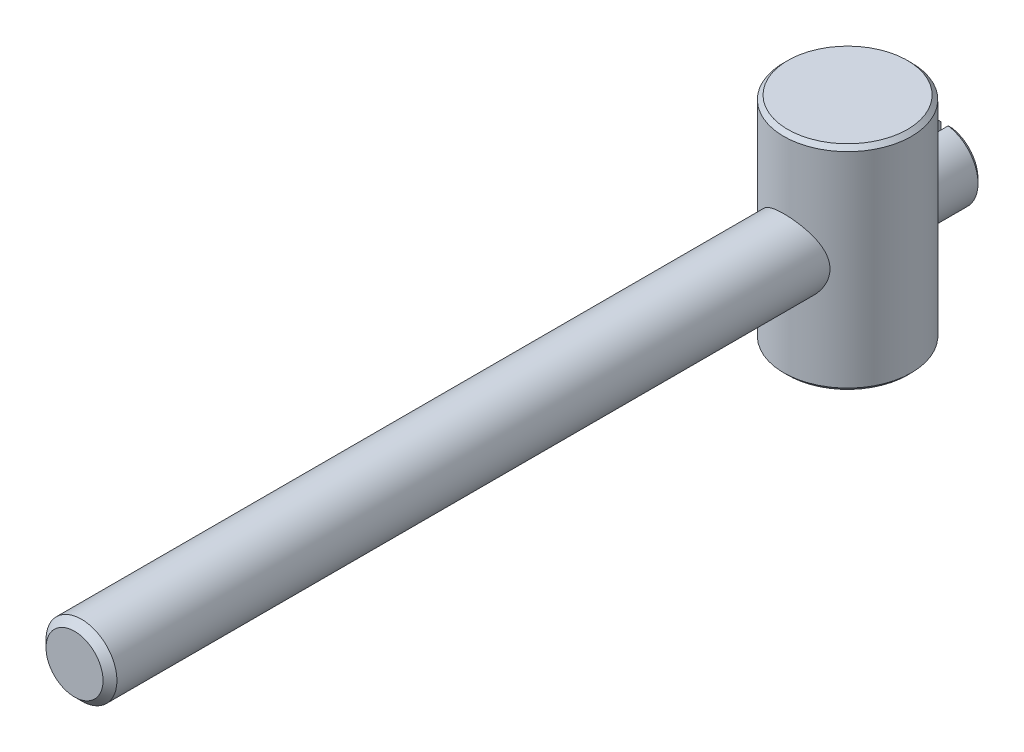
ISO-10303-21;
HEADER;
FILE_DESCRIPTION(('STEP AP214'),'2;1');
FILE_NAME('part.step','',(''),(''),'','','');
FILE_SCHEMA(('AUTOMOTIVE_DESIGN { 1 0 10303 214 1 1 1 1 }'));
ENDSEC;
DATA;
#1=APPLICATION_CONTEXT('core data for automotive mechanical design processes');
#2=APPLICATION_PROTOCOL_DEFINITION('international standard','automotive_design',2000,#1);
#3=PRODUCT_CONTEXT('',#1,'mechanical');
#4=PRODUCT('Part','Part','',(#3));
#5=PRODUCT_RELATED_PRODUCT_CATEGORY('part','',(#4));
#6=PRODUCT_DEFINITION_FORMATION('','',#4);
#7=PRODUCT_DEFINITION_CONTEXT('part definition',#1,'design');
#8=PRODUCT_DEFINITION('design','',#6,#7);
#9=PRODUCT_DEFINITION_SHAPE('','',#8);
#10=(LENGTH_UNIT() NAMED_UNIT(*) SI_UNIT(.MILLI.,.METRE.));
#11=(NAMED_UNIT(*) PLANE_ANGLE_UNIT() SI_UNIT($,.RADIAN.));
#12=(NAMED_UNIT(*) SI_UNIT($,.STERADIAN.) SOLID_ANGLE_UNIT());
#13=UNCERTAINTY_MEASURE_WITH_UNIT(LENGTH_MEASURE(1.E-05),#10,'distance_accuracy_value','');
#14=(GEOMETRIC_REPRESENTATION_CONTEXT(3) GLOBAL_UNCERTAINTY_ASSIGNED_CONTEXT((#13)) GLOBAL_UNIT_ASSIGNED_CONTEXT((#10,
#11,#12)) REPRESENTATION_CONTEXT('',''));
#15=CARTESIAN_POINT('',(0.,0.,0.));
#16=DIRECTION('',(0.,0.,1.));
#17=DIRECTION('',(1.,0.,0.));
#18=AXIS2_PLACEMENT_3D('',#15,#16,#17);
#19=CARTESIAN_POINT('',(0.,0.,-10.2));
#20=DIRECTION('',(0.,0.,1.));
#21=DIRECTION('',(1.,0.,0.));
#22=AXIS2_PLACEMENT_3D('',#19,#20,#21);
#23=CYLINDRICAL_SURFACE('',#22,2.5);
#24=CARTESIAN_POINT('',(2.5,0.,-10.9583426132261));
#25=CARTESIAN_POINT('',(2.4999886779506,-0.127867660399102,-10.9583273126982));
#26=CARTESIAN_POINT('',(2.49012046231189,-0.255847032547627,-10.9516829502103));
#27=CARTESIAN_POINT('',(2.45123834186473,-0.507679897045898,-10.92615160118));
#28=CARTESIAN_POINT('',(2.42219296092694,-0.631526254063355,-10.9072444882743));
#29=CARTESIAN_POINT('',(2.34672518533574,-0.870945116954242,-10.8601006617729));
#30=CARTESIAN_POINT('',(2.30041313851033,-0.986564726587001,-10.8319233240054));
#31=CARTESIAN_POINT('',(2.19206578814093,-1.20834600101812,-10.7695105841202));
#32=CARTESIAN_POINT('',(2.13002699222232,-1.31450555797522,-10.7352738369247));
#33=CARTESIAN_POINT('',(1.98449846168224,-1.52641671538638,-10.6603059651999));
#34=CARTESIAN_POINT('',(1.89945493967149,-1.63099357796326,-10.6192693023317));
#35=CARTESIAN_POINT('',(1.71353751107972,-1.82534633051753,-10.5377770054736));
#36=CARTESIAN_POINT('',(1.61265398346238,-1.91511315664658,-10.4973217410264));
#37=CARTESIAN_POINT('',(1.3870985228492,-2.08508983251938,-10.4173035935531));
#38=CARTESIAN_POINT('',(1.26111369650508,-2.16376032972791,-10.3781335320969));
#39=CARTESIAN_POINT('',(0.995108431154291,-2.29824166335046,-10.3092628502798));
#40=CARTESIAN_POINT('',(0.855099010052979,-2.35407027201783,-10.2795548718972));
#41=CARTESIAN_POINT('',(0.577542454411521,-2.43630568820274,-10.2351937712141));
#42=CARTESIAN_POINT('',(0.440787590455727,-2.46480060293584,-10.2194803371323));
#43=CARTESIAN_POINT('',(0.163616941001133,-2.49853448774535,-10.2008373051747));
#44=CARTESIAN_POINT('',(0.0232040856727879,-2.50379152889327,-10.1978977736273));
#45=CARTESIAN_POINT('',(-0.241178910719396,-2.4914765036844,-10.2047304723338));
#46=CARTESIAN_POINT('',(-0.365303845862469,-2.47628215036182,-10.2131788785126));
#47=CARTESIAN_POINT('',(-0.608906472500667,-2.42789099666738,-10.2397034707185));
#48=CARTESIAN_POINT('',(-0.728383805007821,-2.39469280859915,-10.2577803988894));
#49=CARTESIAN_POINT('',(-0.960979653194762,-2.31126649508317,-10.3021939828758));
#50=CARTESIAN_POINT('',(-1.07401990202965,-2.26086630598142,-10.3286138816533));
#51=CARTESIAN_POINT('',(-1.29025059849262,-2.14483738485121,-10.3874800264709));
#52=CARTESIAN_POINT('',(-1.39343793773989,-2.07920386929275,-10.4199281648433));
#53=CARTESIAN_POINT('',(-1.59909620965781,-1.92640653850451,-10.4921471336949));
#54=CARTESIAN_POINT('',(-1.70025747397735,-1.83767397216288,-10.5323306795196));
#55=CARTESIAN_POINT('',(-1.88703556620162,-1.64533173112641,-10.6134989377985));
#56=CARTESIAN_POINT('',(-1.97263574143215,-1.54170632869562,-10.6544844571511));
#57=CARTESIAN_POINT('',(-2.13367090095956,-1.31107929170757,-10.736876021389));
#58=CARTESIAN_POINT('',(-2.2074790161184,-1.1828097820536,-10.7779828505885));
#59=CARTESIAN_POINT('',(-2.30082855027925,-0.98066900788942,-10.8325082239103));
#60=CARTESIAN_POINT('',(-2.32905476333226,-0.91165285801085,-10.8494965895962));
#61=CARTESIAN_POINT('',(-2.3793879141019,-0.770776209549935,-10.8803947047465));
#62=CARTESIAN_POINT('',(-2.4014990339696,-0.698917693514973,-10.8943065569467));
#63=CARTESIAN_POINT('',(-2.43774893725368,-0.558744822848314,-10.9174339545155));
#64=CARTESIAN_POINT('',(-2.45238335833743,-0.490605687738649,-10.92693581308));
#65=CARTESIAN_POINT('',(-2.47593920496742,-0.352979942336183,-10.9423512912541));
#66=CARTESIAN_POINT('',(-2.48486399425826,-0.283494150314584,-10.9482670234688));
#67=CARTESIAN_POINT('',(-2.49684067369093,-0.143844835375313,-10.9562264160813));
#68=CARTESIAN_POINT('',(-2.49989709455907,-0.0736818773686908,-10.9582730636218));
#69=CARTESIAN_POINT('',(-2.5000979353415,0.0666321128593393,-10.958408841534));
#70=CARTESIAN_POINT('',(-2.49724303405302,0.136783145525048,-10.9564984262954));
#71=CARTESIAN_POINT('',(-2.48160454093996,0.325212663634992,-10.9460933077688));
#72=CARTESIAN_POINT('',(-2.4632791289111,0.442885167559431,-10.9339318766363));
#73=CARTESIAN_POINT('',(-2.41059641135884,0.673061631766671,-10.9000032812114));
#74=CARTESIAN_POINT('',(-2.37623178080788,0.785563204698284,-10.8782317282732));
#75=CARTESIAN_POINT('',(-2.29111009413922,1.00774180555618,-10.8265799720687));
#76=CARTESIAN_POINT('',(-2.23973536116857,1.11711092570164,-10.796402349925));
#77=CARTESIAN_POINT('',(-2.12255957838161,1.32632576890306,-10.7314706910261));
#78=CARTESIAN_POINT('',(-2.05675148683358,1.42616680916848,-10.6967144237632));
#79=CARTESIAN_POINT('',(-1.90016864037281,1.63049062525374,-10.6197869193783));
#80=CARTESIAN_POINT('',(-1.80707526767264,1.73309682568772,-10.5773277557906));
#81=CARTESIAN_POINT('',(-1.60470900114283,1.92199935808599,-10.4944234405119));
#82=CARTESIAN_POINT('',(-1.49542618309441,2.00828561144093,-10.453979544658));
#83=CARTESIAN_POINT('',(-1.25626042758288,2.16643294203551,-10.376991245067));
#84=CARTESIAN_POINT('',(-1.12558547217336,2.23726807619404,-10.3407737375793));
#85=CARTESIAN_POINT('',(-0.851602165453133,2.35519631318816,-10.2790936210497));
#86=CARTESIAN_POINT('',(-0.708307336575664,2.40231447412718,-10.2536196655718));
#87=CARTESIAN_POINT('',(-0.428990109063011,2.46664777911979,-10.218514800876));
#88=CARTESIAN_POINT('',(-0.293732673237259,2.48643742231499,-10.2075252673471));
#89=CARTESIAN_POINT('',(-0.0213910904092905,2.50362240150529,-10.1979932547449));
#90=CARTESIAN_POINT('',(0.115692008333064,2.50103007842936,-10.1994439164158));
#91=CARTESIAN_POINT('',(0.374337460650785,2.47491437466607,-10.2138982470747));
#92=CARTESIAN_POINT('',(0.49616574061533,2.45334235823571,-10.2258246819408));
#93=CARTESIAN_POINT('',(0.734167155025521,2.39292228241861,-10.2586674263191));
#94=CARTESIAN_POINT('',(0.8503396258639,2.3540722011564,-10.279584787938));
#95=CARTESIAN_POINT('',(1.0781477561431,2.25905612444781,-10.3294567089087));
#96=CARTESIAN_POINT('',(1.18950897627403,2.202363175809,-10.358652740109));
#97=CARTESIAN_POINT('',(1.40148896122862,2.07393542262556,-10.422372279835));
#98=CARTESIAN_POINT('',(1.50210346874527,2.00219469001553,-10.4568978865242));
#99=CARTESIAN_POINT('',(1.70217916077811,1.83613517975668,-10.532828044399));
#100=CARTESIAN_POINT('',(1.8001424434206,1.74016022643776,-10.5745654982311));
#101=CARTESIAN_POINT('',(1.97933250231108,1.53330418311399,-10.6574745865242));
#102=CARTESIAN_POINT('',(2.06053826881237,1.42240466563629,-10.6986454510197));
#103=CARTESIAN_POINT('',(2.20944802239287,1.17899936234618,-10.7787759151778));
#104=CARTESIAN_POINT('',(2.27579178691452,1.04552040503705,-10.8173734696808));
#105=CARTESIAN_POINT('',(2.35707752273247,0.83652666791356,-10.8665699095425));
#106=CARTESIAN_POINT('',(2.38112244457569,0.765460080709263,-10.881510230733));
#107=CARTESIAN_POINT('',(2.4228459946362,0.620861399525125,-10.9078467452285));
#108=CARTESIAN_POINT('',(2.44052862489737,0.547330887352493,-10.9192451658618));
#109=CARTESIAN_POINT('',(2.4697920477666,0.395409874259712,-10.9382915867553));
#110=CARTESIAN_POINT('',(2.48109451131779,0.316943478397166,-10.9457676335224));
#111=CARTESIAN_POINT('',(2.49620181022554,0.158999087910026,-10.9557977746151));
#112=CARTESIAN_POINT('',(2.50000704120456,0.0795211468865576,-10.9583521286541));
#113=CARTESIAN_POINT('',(2.5,0.,-10.9583426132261));
#114=B_SPLINE_CURVE_WITH_KNOTS('',3,(#24,#25,#26,#27,#28,#29,#30,#31,#32,#33,#34,#35,#36,#37,
#38,#39,#40,#41,#42,#43,#44,#45,#46,#47,#48,#49,#50,#51,#52,#53,#54,#55,#56,#57,#58,#59,#60,#61,
#62,#63,#64,#65,#66,#67,#68,#69,#70,#71,#72,#73,#74,#75,#76,#77,#78,#79,#80,#81,#82,#83,#84,#85,
#86,#87,#88,#89,#90,#91,#92,#93,#94,#95,#96,#97,#98,#99,#100,#101,#102,#103,#104,#105,#106,#107,
#108,#109,#110,#111,#112,#113),.UNSPECIFIED.,.T.,.F.,(4,2,2,2,2,2,2,2,2,2,2,2,2,2,2,2,2,2,2,2,2,
2,2,2,2,2,2,2,2,2,2,2,2,2,2,2,2,2,2,2,2,2,2,2,4),(0.,0.383275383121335,0.767181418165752,
1.14867490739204,1.53025318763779,1.95124472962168,2.37249297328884,2.8308639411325,
3.2888775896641,3.70817544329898,4.12714717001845,4.50138183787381,4.8756453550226,
5.25376784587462,5.63200923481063,6.05157027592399,6.47157769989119,6.92969119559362,
7.15882945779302,7.38781062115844,7.59850621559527,7.80907756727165,8.01948627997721,
8.22987083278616,8.58719279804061,8.94467811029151,9.31690871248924,9.68932132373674,
10.122176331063,10.5552977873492,11.0117233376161,11.4676656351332,11.8767730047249,
12.2856548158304,12.6568475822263,13.0280837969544,13.4115163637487,13.7951002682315,
14.2233400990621,14.6521136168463,15.1111969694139,15.3403711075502,15.5694008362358,
15.80777312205,16.0461328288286),.UNSPECIFIED.);
#115=CARTESIAN_POINT('',(2.5,0.,-10.9583426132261));
#116=VERTEX_POINT('',#115);
#117=EDGE_CURVE('E196',#116,#116,#114,.T.);
#118=ORIENTED_EDGE('',*,*,#117,.F.);
#119=EDGE_LOOP('',(#118));
#120=FACE_BOUND('',#119,.T.);
#121=CARTESIAN_POINT('',(0.,0.,39.3095));
#122=DIRECTION('',(0.,0.,1.));
#123=DIRECTION('',(1.,0.,0.));
#124=AXIS2_PLACEMENT_3D('',#121,#122,#123);
#125=CIRCLE('',#124,2.5);
#126=CARTESIAN_POINT('',(2.5,0.,39.3095));
#127=VERTEX_POINT('',#126);
#128=EDGE_CURVE('E204',#127,#127,#125,.T.);
#129=ORIENTED_EDGE('',*,*,#128,.F.);
#130=EDGE_LOOP('',(#129));
#131=FACE_BOUND('',#130,.T.);
#132=ADVANCED_FACE('F14',(#120,#131),#23,.T.);
#133=CARTESIAN_POINT('',(0.,0.,-21.3935));
#134=DIRECTION('',(0.,0.,1.));
#135=DIRECTION('',(1.,0.,0.));
#136=AXIS2_PLACEMENT_3D('',#133,#134,#135);
#137=CIRCLE('',#136,2.5);
#138=CARTESIAN_POINT('',(-0.4,2.46779253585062,-21.3935));
#139=VERTEX_POINT('',#138);
#140=CARTESIAN_POINT('',(-0.4,-2.46779253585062,-21.3935));
#141=VERTEX_POINT('',#140);
#142=EDGE_CURVE('E101',#139,#141,#137,.T.);
#143=ORIENTED_EDGE('',*,*,#142,.T.);
#144=DIRECTION('',(0.,0.,1.));
#145=VECTOR('',#144,1.);
#146=CARTESIAN_POINT('',(-0.4,-2.46779253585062,-10.2));
#147=LINE('',#146,#145);
#148=CARTESIAN_POINT('',(-0.4,-2.46779253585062,-20.296815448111));
#149=VERTEX_POINT('',#148);
#150=EDGE_CURVE('E148',#141,#149,#147,.T.);
#151=ORIENTED_EDGE('',*,*,#150,.T.);
#152=CARTESIAN_POINT('',(0.4,-2.46779253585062,-20.296815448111));
#153=CARTESIAN_POINT('',(0.333698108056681,-2.47854531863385,-20.2976618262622));
#154=CARTESIAN_POINT('',(0.266959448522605,-2.48661458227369,-20.298300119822));
#155=CARTESIAN_POINT('',(0.133478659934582,-2.49732458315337,-20.2991493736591));
#156=CARTESIAN_POINT('',(0.066739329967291,-2.5,-20.2993630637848));
#157=CARTESIAN_POINT('',(-0.066739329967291,-2.5,-20.2993630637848));
#158=CARTESIAN_POINT('',(-0.133478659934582,-2.49732458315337,-20.2991493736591));
#159=CARTESIAN_POINT('',(-0.266959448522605,-2.48661458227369,-20.298300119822));
#160=CARTESIAN_POINT('',(-0.333698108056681,-2.47854531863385,-20.2976618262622));
#161=CARTESIAN_POINT('',(-0.4,-2.46779253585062,-20.296815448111));
#162=B_SPLINE_CURVE_WITH_KNOTS('',3,(#152,#153,#154,#155,#156,#157,#158,#159,#160,#161),
.UNSPECIFIED.,.F.,.F.,(4,2,2,2,4),(0.,0.201464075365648,0.401628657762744,0.601793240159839,
0.803257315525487),.UNSPECIFIED.);
#163=CARTESIAN_POINT('',(0.4,-2.46779253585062,-20.296815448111));
#164=VERTEX_POINT('',#163);
#165=EDGE_CURVE('E141',#164,#149,#162,.T.);
#166=ORIENTED_EDGE('',*,*,#165,.F.);
#167=DIRECTION('',(0.,0.,1.));
#168=VECTOR('',#167,1.);
#169=CARTESIAN_POINT('',(0.4,-2.46779253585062,-10.2));
#170=LINE('',#169,#168);
#171=CARTESIAN_POINT('',(0.4,-2.46779253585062,-21.3935));
#172=VERTEX_POINT('',#171);
#173=EDGE_CURVE('E32',#172,#164,#170,.T.);
#174=ORIENTED_EDGE('',*,*,#173,.F.);
#175=CARTESIAN_POINT('',(0.4,2.46779253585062,-21.3935));
#176=VERTEX_POINT('',#175);
#177=EDGE_CURVE('E86',#172,#176,#137,.T.);
#178=ORIENTED_EDGE('',*,*,#177,.T.);
#179=DIRECTION('',(0.,0.,1.));
#180=VECTOR('',#179,1.);
#181=CARTESIAN_POINT('',(0.4,2.46779253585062,-10.2));
#182=LINE('',#181,#180);
#183=CARTESIAN_POINT('',(0.4,2.46779253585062,-20.296815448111));
#184=VERTEX_POINT('',#183);
#185=EDGE_CURVE('E38',#184,#176,#182,.F.);
#186=ORIENTED_EDGE('',*,*,#185,.F.);
#187=CARTESIAN_POINT('',(-0.4,2.46779253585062,-20.296815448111));
#188=CARTESIAN_POINT('',(-0.333698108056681,2.47854531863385,-20.2976618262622));
#189=CARTESIAN_POINT('',(-0.266959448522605,2.48661458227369,-20.298300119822));
#190=CARTESIAN_POINT('',(-0.133478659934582,2.49732458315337,-20.2991493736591));
#191=CARTESIAN_POINT('',(-0.066739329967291,2.5,-20.2993630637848));
#192=CARTESIAN_POINT('',(0.066739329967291,2.5,-20.2993630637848));
#193=CARTESIAN_POINT('',(0.133478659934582,2.49732458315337,-20.2991493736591));
#194=CARTESIAN_POINT('',(0.266959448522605,2.48661458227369,-20.298300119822));
#195=CARTESIAN_POINT('',(0.333698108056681,2.47854531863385,-20.2976618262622));
#196=CARTESIAN_POINT('',(0.4,2.46779253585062,-20.296815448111));
#197=B_SPLINE_CURVE_WITH_KNOTS('',3,(#187,#188,#189,#190,#191,#192,#193,#194,#195,#196),
.UNSPECIFIED.,.F.,.F.,(4,2,2,2,4),(0.,0.201464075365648,0.401628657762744,0.601793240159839,
0.803257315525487),.UNSPECIFIED.);
#198=CARTESIAN_POINT('',(-0.4,2.46779253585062,-20.296815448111));
#199=VERTEX_POINT('',#198);
#200=EDGE_CURVE('E73',#199,#184,#197,.T.);
#201=ORIENTED_EDGE('',*,*,#200,.F.);
#202=DIRECTION('',(0.,0.,1.));
#203=VECTOR('',#202,1.);
#204=CARTESIAN_POINT('',(-0.4,2.46779253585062,-10.2));
#205=LINE('',#204,#203);
#206=EDGE_CURVE('E79',#199,#139,#205,.F.);
#207=ORIENTED_EDGE('',*,*,#206,.T.);
#208=EDGE_LOOP('',(#143,#151,#166,#174,#178,#186,#201,#207));
#209=FACE_BOUND('',#208,.T.);
#210=CARTESIAN_POINT('',(2.5,0.,-18.441657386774));
#211=CARTESIAN_POINT('',(2.4999886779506,0.127867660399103,-18.4416726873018));
#212=CARTESIAN_POINT('',(2.49012046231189,0.255847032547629,-18.4483170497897));
#213=CARTESIAN_POINT('',(2.45123834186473,0.507679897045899,-18.47384839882));
#214=CARTESIAN_POINT('',(2.42219296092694,0.631526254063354,-18.4927555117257));
#215=CARTESIAN_POINT('',(2.34672518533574,0.870945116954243,-18.5398993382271));
#216=CARTESIAN_POINT('',(2.30041313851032,0.986564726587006,-18.5680766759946));
#217=CARTESIAN_POINT('',(2.19206578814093,1.20834600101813,-18.6304894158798));
#218=CARTESIAN_POINT('',(2.13002699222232,1.31450555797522,-18.6647261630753));
#219=CARTESIAN_POINT('',(1.98449846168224,1.52641671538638,-18.7396940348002));
#220=CARTESIAN_POINT('',(1.89945493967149,1.63099357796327,-18.7807306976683));
#221=CARTESIAN_POINT('',(1.71353751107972,1.82534633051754,-18.8622229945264));
#222=CARTESIAN_POINT('',(1.61265398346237,1.91511315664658,-18.9026782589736));
#223=CARTESIAN_POINT('',(1.3870985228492,2.08508983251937,-18.982696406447));
#224=CARTESIAN_POINT('',(1.26111369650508,2.16376032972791,-19.0218664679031));
#225=CARTESIAN_POINT('',(0.995108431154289,2.29824166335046,-19.0907371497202));
#226=CARTESIAN_POINT('',(0.855099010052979,2.35407027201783,-19.1204451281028));
#227=CARTESIAN_POINT('',(0.577542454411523,2.43630568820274,-19.1648062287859));
#228=CARTESIAN_POINT('',(0.440787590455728,2.46480060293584,-19.1805196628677));
#229=CARTESIAN_POINT('',(0.163616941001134,2.49853448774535,-19.1991626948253));
#230=CARTESIAN_POINT('',(0.0232040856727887,2.50379152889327,-19.2021022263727));
#231=CARTESIAN_POINT('',(-0.241178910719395,2.4914765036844,-19.1952695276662));
#232=CARTESIAN_POINT('',(-0.365303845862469,2.47628215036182,-19.1868211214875));
#233=CARTESIAN_POINT('',(-0.608906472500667,2.42789099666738,-19.1602965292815));
#234=CARTESIAN_POINT('',(-0.728383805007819,2.39469280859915,-19.1422196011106));
#235=CARTESIAN_POINT('',(-0.960979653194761,2.31126649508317,-19.0978060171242));
#236=CARTESIAN_POINT('',(-1.07401990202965,2.26086630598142,-19.0713861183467));
#237=CARTESIAN_POINT('',(-1.29025059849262,2.14483738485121,-19.0125199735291));
#238=CARTESIAN_POINT('',(-1.39343793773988,2.07920386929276,-18.9800718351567));
#239=CARTESIAN_POINT('',(-1.59909620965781,1.9264065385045,-18.9078528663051));
#240=CARTESIAN_POINT('',(-1.70025747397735,1.83767397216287,-18.8676693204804));
#241=CARTESIAN_POINT('',(-1.88703556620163,1.64533173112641,-18.7865010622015));
#242=CARTESIAN_POINT('',(-1.97263574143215,1.54170632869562,-18.7455155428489));
#243=CARTESIAN_POINT('',(-2.13367090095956,1.31107929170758,-18.663123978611));
#244=CARTESIAN_POINT('',(-2.2074790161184,1.1828097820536,-18.6220171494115));
#245=CARTESIAN_POINT('',(-2.30082855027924,0.980669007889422,-18.5674917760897));
#246=CARTESIAN_POINT('',(-2.32905476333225,0.911652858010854,-18.5505034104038));
#247=CARTESIAN_POINT('',(-2.3793879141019,0.770776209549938,-18.5196052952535));
#248=CARTESIAN_POINT('',(-2.4014990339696,0.698917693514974,-18.5056934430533));
#249=CARTESIAN_POINT('',(-2.43774893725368,0.558744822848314,-18.4825660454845));
#250=CARTESIAN_POINT('',(-2.45238335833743,0.490605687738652,-18.47306418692));
#251=CARTESIAN_POINT('',(-2.47593920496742,0.352979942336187,-18.4576487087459));
#252=CARTESIAN_POINT('',(-2.48486399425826,0.283494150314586,-18.4517329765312));
#253=CARTESIAN_POINT('',(-2.49684067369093,0.143844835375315,-18.4437735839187));
#254=CARTESIAN_POINT('',(-2.49989709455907,0.0736818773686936,-18.4417269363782));
#255=CARTESIAN_POINT('',(-2.5000979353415,-0.0666321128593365,-18.441591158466));
#256=CARTESIAN_POINT('',(-2.49724303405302,-0.136783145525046,-18.4435015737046));
#257=CARTESIAN_POINT('',(-2.48160454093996,-0.325212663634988,-18.4539066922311));
#258=CARTESIAN_POINT('',(-2.46327912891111,-0.442885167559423,-18.4660681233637));
#259=CARTESIAN_POINT('',(-2.41059641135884,-0.673061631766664,-18.4999967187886));
#260=CARTESIAN_POINT('',(-2.37623178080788,-0.785563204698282,-18.5217682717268));
#261=CARTESIAN_POINT('',(-2.29111009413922,-1.00774180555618,-18.5734200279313));
#262=CARTESIAN_POINT('',(-2.23973536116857,-1.11711092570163,-18.603597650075));
#263=CARTESIAN_POINT('',(-2.12255957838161,-1.32632576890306,-18.668529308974));
#264=CARTESIAN_POINT('',(-2.05675148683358,-1.42616680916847,-18.7032855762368));
#265=CARTESIAN_POINT('',(-1.90016864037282,-1.63049062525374,-18.7802130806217));
#266=CARTESIAN_POINT('',(-1.80707526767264,-1.73309682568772,-18.8226722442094));
#267=CARTESIAN_POINT('',(-1.60470900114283,-1.92199935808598,-18.9055765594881));
#268=CARTESIAN_POINT('',(-1.49542618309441,-2.00828561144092,-18.946020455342));
#269=CARTESIAN_POINT('',(-1.25626042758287,-2.16643294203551,-19.0230087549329));
#270=CARTESIAN_POINT('',(-1.12558547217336,-2.23726807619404,-19.0592262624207));
#271=CARTESIAN_POINT('',(-0.851602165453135,-2.35519631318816,-19.1209063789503));
#272=CARTESIAN_POINT('',(-0.708307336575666,-2.40231447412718,-19.1463803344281));
#273=CARTESIAN_POINT('',(-0.428990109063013,-2.46664777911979,-19.181485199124));
#274=CARTESIAN_POINT('',(-0.293732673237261,-2.48643742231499,-19.1924747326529));
#275=CARTESIAN_POINT('',(-0.0213910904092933,-2.50362240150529,-19.2020067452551));
#276=CARTESIAN_POINT('',(0.115692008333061,-2.50103007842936,-19.2005560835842));
#277=CARTESIAN_POINT('',(0.374337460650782,-2.47491437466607,-19.1861017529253));
#278=CARTESIAN_POINT('',(0.496165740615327,-2.45334235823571,-19.1741753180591));
#279=CARTESIAN_POINT('',(0.73416715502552,-2.39292228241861,-19.1413325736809));
#280=CARTESIAN_POINT('',(0.8503396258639,-2.3540722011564,-19.120415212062));
#281=CARTESIAN_POINT('',(1.07814775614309,-2.25905612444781,-19.0705432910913));
#282=CARTESIAN_POINT('',(1.18950897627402,-2.202363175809,-19.041347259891));
#283=CARTESIAN_POINT('',(1.40148896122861,-2.07393542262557,-18.977627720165));
#284=CARTESIAN_POINT('',(1.50210346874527,-2.00219469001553,-18.9431021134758));
#285=CARTESIAN_POINT('',(1.7021791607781,-1.83613517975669,-18.867171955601));
#286=CARTESIAN_POINT('',(1.80014244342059,-1.74016022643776,-18.825434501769));
#287=CARTESIAN_POINT('',(1.97933250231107,-1.533304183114,-18.7425254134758));
#288=CARTESIAN_POINT('',(2.06053826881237,-1.42240466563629,-18.7013545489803));
#289=CARTESIAN_POINT('',(2.20944802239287,-1.17899936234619,-18.6212240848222));
#290=CARTESIAN_POINT('',(2.27579178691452,-1.04552040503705,-18.5826265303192));
#291=CARTESIAN_POINT('',(2.35707752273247,-0.83652666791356,-18.5334300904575));
#292=CARTESIAN_POINT('',(2.38112244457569,-0.765460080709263,-18.518489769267));
#293=CARTESIAN_POINT('',(2.4228459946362,-0.620861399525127,-18.4921532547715));
#294=CARTESIAN_POINT('',(2.44052862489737,-0.547330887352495,-18.4807548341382));
#295=CARTESIAN_POINT('',(2.4697920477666,-0.395409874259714,-18.4617084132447));
#296=CARTESIAN_POINT('',(2.48109451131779,-0.316943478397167,-18.4542323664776));
#297=CARTESIAN_POINT('',(2.49620181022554,-0.158999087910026,-18.4442022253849));
#298=CARTESIAN_POINT('',(2.50000704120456,-0.0795211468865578,-18.4416478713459));
#299=CARTESIAN_POINT('',(2.5,0.,-18.441657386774));
#300=B_SPLINE_CURVE_WITH_KNOTS('',3,(#210,#211,#212,#213,#214,#215,#216,#217,#218,#219,#220,
#221,#222,#223,#224,#225,#226,#227,#228,#229,#230,#231,#232,#233,#234,#235,#236,#237,#238,#239,
#240,#241,#242,#243,#244,#245,#246,#247,#248,#249,#250,#251,#252,#253,#254,#255,#256,#257,#258,
#259,#260,#261,#262,#263,#264,#265,#266,#267,#268,#269,#270,#271,#272,#273,#274,#275,#276,#277,
#278,#279,#280,#281,#282,#283,#284,#285,#286,#287,#288,#289,#290,#291,#292,#293,#294,#295,#296,
#297,#298,#299),.UNSPECIFIED.,.T.,.F.,(4,2,2,2,2,2,2,2,2,2,2,2,2,2,2,2,2,2,2,2,2,2,2,2,2,2,2,2,
2,2,2,2,2,2,2,2,2,2,2,2,2,2,2,2,4),(0.,0.383275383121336,0.767181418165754,1.14867490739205,
1.53025318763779,1.95124472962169,2.37249297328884,2.8308639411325,3.2888775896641,
3.70817544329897,4.12714717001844,4.50138183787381,4.8756453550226,5.25376784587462,
5.63200923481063,6.05157027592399,6.47157769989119,6.92969119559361,7.15882945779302,
7.38781062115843,7.59850621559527,7.80907756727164,8.0194862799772,8.22987083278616,
8.5871927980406,8.9446781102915,9.31690871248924,9.68932132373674,10.122176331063,
10.5552977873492,11.0117233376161,11.4676656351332,11.8767730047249,12.2856548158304,
12.6568475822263,13.0280837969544,13.4115163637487,13.7951002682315,14.2233400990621,
14.6521136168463,15.1111969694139,15.3403711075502,15.5694008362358,15.80777312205,
16.0461328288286),.UNSPECIFIED.);
#301=CARTESIAN_POINT('',(2.5,0.,-18.441657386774));
#302=VERTEX_POINT('',#301);
#303=EDGE_CURVE('E192',#302,#302,#300,.T.);
#304=ORIENTED_EDGE('',*,*,#303,.F.);
#305=EDGE_LOOP('',(#304));
#306=FACE_BOUND('',#305,.T.);
#307=ADVANCED_FACE('F83',(#209,#306),#23,.T.);
#308=CARTESIAN_POINT('',(0.,0.,-21.7));
#309=DIRECTION('',(0.,0.,1.));
#310=DIRECTION('',(1.,0.,0.));
#311=AXIS2_PLACEMENT_3D('',#308,#309,#310);
#312=PLANE('',#311);
#313=DIRECTION('',(0.,-1.,0.));
#314=VECTOR('',#313,1.);
#315=CARTESIAN_POINT('',(0.4,0.,-21.7));
#316=LINE('',#315,#314);
#317=CARTESIAN_POINT('',(0.4,2.15672025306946,-21.7));
#318=VERTEX_POINT('',#317);
#319=CARTESIAN_POINT('',(0.4,-2.15672025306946,-21.7));
#320=VERTEX_POINT('',#319);
#321=EDGE_CURVE('E116',#318,#320,#316,.T.);
#322=ORIENTED_EDGE('',*,*,#321,.F.);
#323=CARTESIAN_POINT('',(0.,0.,-21.7));
#324=DIRECTION('',(0.,0.,1.));
#325=DIRECTION('',(1.,0.,0.));
#326=AXIS2_PLACEMENT_3D('',#323,#324,#325);
#327=CIRCLE('',#326,2.1935);
#328=EDGE_CURVE('E90',#320,#318,#327,.T.);
#329=ORIENTED_EDGE('',*,*,#328,.F.);
#330=EDGE_LOOP('',(#322,#329));
#331=FACE_BOUND('',#330,.T.);
#332=ADVANCED_FACE('F157',(#331),#312,.F.);
#333=CARTESIAN_POINT('',(0.,0.,-21.7));
#334=DIRECTION('',(0.,0.,1.));
#335=DIRECTION('',(1.,0.,0.));
#336=AXIS2_PLACEMENT_3D('',#333,#334,#335);
#337=CONICAL_SURFACE('',#336,2.1935,0.785398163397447);
#338=CARTESIAN_POINT('',(0.4,2.46850166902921,-21.3928));
#339=CARTESIAN_POINT('',(0.4,2.39793497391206,-21.4624547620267));
#340=CARTESIAN_POINT('',(0.4,2.32733326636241,-21.5320741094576));
#341=CARTESIAN_POINT('',(0.4,2.18597809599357,-21.6712614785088));
#342=CARTESIAN_POINT('',(0.4,2.11522456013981,-21.7408294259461));
#343=CARTESIAN_POINT('',(0.4,1.97263911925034,-21.8807619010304));
#344=CARTESIAN_POINT('',(0.4,1.90080545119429,-21.9511246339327));
#345=CARTESIAN_POINT('',(0.4,1.75700155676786,-22.0916061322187));
#346=CARTESIAN_POINT('',(0.4,1.68503146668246,-22.1617250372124));
#347=CARTESIAN_POINT('',(0.4,1.5086325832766,-22.3329478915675));
#348=CARTESIAN_POINT('',(0.4,1.40406116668,-22.4339055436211));
#349=CARTESIAN_POINT('',(0.4,1.24630024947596,-22.5846719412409));
#350=CARTESIAN_POINT('',(0.4,1.1934932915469,-22.6348806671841));
#351=CARTESIAN_POINT('',(0.4,1.08751861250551,-22.73488634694));
#352=CARTESIAN_POINT('',(0.4,1.03435099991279,-22.7846834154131));
#353=CARTESIAN_POINT('',(0.4,0.928027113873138,-22.8831356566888));
#354=CARTESIAN_POINT('',(0.4,0.87487688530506,-22.9317973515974));
#355=CARTESIAN_POINT('',(0.4,0.767646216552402,-23.0282154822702));
#356=CARTESIAN_POINT('',(0.4,0.713564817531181,-23.0759708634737));
#357=CARTESIAN_POINT('',(0.4,0.63143350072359,-23.1461630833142));
#358=CARTESIAN_POINT('',(0.4,0.603955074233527,-23.1692668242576));
#359=CARTESIAN_POINT('',(0.4,0.548479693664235,-23.2148412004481));
#360=CARTESIAN_POINT('',(0.4,0.520482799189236,-23.2373119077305));
#361=CARTESIAN_POINT('',(0.4,0.463815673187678,-23.2812861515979));
#362=CARTESIAN_POINT('',(0.4,0.435146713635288,-23.3027913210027));
#363=CARTESIAN_POINT('',(0.4,0.376790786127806,-23.3443654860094));
#364=CARTESIAN_POINT('',(0.4,0.347104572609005,-23.364435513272));
#365=CARTESIAN_POINT('',(0.4,0.309473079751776,-23.3877901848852));
#366=CARTESIAN_POINT('',(0.4,0.302223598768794,-23.3921969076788));
#367=CARTESIAN_POINT('',(0.4,0.287631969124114,-23.4008566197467));
#368=CARTESIAN_POINT('',(0.4,0.28028980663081,-23.4051095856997));
#369=CARTESIAN_POINT('',(0.4,0.258114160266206,-23.4176076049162));
#370=CARTESIAN_POINT('',(0.4,0.243131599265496,-23.4255917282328));
#371=CARTESIAN_POINT('',(0.4,0.212839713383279,-23.4405880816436));
#372=CARTESIAN_POINT('',(0.4,0.197534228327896,-23.4476079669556));
#373=CARTESIAN_POINT('',(0.4,0.166442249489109,-23.460484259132));
#374=CARTESIAN_POINT('',(0.4,0.150655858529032,-23.4663409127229));
#375=CARTESIAN_POINT('',(0.4,0.111435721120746,-23.4788472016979));
#376=CARTESIAN_POINT('',(0.4,0.0877285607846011,-23.4846874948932));
#377=CARTESIAN_POINT('',(0.4,0.0397057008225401,-23.4922264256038));
#378=CARTESIAN_POINT('',(0.4,0.0153922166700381,-23.4939383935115));
#379=CARTESIAN_POINT('',(0.4,-0.0331703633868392,-23.4928640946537));
#380=CARTESIAN_POINT('',(0.4,-0.0574192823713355,-23.4900702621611));
#381=CARTESIAN_POINT('',(0.4,-0.10517632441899,-23.4805736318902));
#382=CARTESIAN_POINT('',(0.4,-0.128681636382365,-23.4738575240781));
#383=CARTESIAN_POINT('',(0.4,-0.178283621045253,-23.4562788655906));
#384=CARTESIAN_POINT('',(0.4,-0.20420033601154,-23.4449277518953));
#385=CARTESIAN_POINT('',(0.4,-0.254817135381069,-23.4197398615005));
#386=CARTESIAN_POINT('',(0.4,-0.279514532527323,-23.4058978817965));
#387=CARTESIAN_POINT('',(0.4,-0.328121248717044,-23.3765020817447));
#388=CARTESIAN_POINT('',(0.4,-0.352022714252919,-23.3609354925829));
#389=CARTESIAN_POINT('',(0.4,-0.399055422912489,-23.3287412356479));
#390=CARTESIAN_POINT('',(0.4,-0.422187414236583,-23.3121146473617));
#391=CARTESIAN_POINT('',(0.4,-0.4702689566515,-23.2763546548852));
#392=CARTESIAN_POINT('',(0.4,-0.495157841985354,-23.2571402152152));
#393=CARTESIAN_POINT('',(0.4,-0.544438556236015,-23.21808210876));
#394=CARTESIAN_POINT('',(0.4,-0.568830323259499,-23.1982383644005));
#395=CARTESIAN_POINT('',(0.4,-0.641472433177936,-23.1380236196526));
#396=CARTESIAN_POINT('',(0.4,-0.689168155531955,-23.0969855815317));
#397=CARTESIAN_POINT('',(0.4,-0.783758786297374,-23.013853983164));
#398=CARTESIAN_POINT('',(0.4,-0.83065225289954,-22.9717588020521));
#399=CARTESIAN_POINT('',(0.4,-0.923855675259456,-22.8869523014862));
#400=CARTESIAN_POINT('',(0.4,-0.970165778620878,-22.8442411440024));
#401=CARTESIAN_POINT('',(0.4,-1.10817311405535,-22.7158338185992));
#402=CARTESIAN_POINT('',(0.4,-1.19931044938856,-22.6295376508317));
#403=CARTESIAN_POINT('',(0.4,-1.38074793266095,-22.4562216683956));
#404=CARTESIAN_POINT('',(0.4,-1.47104870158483,-22.3692024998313));
#405=CARTESIAN_POINT('',(0.4,-1.63710859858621,-22.2083381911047));
#406=CARTESIAN_POINT('',(0.4,-1.71293348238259,-22.1345609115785));
#407=CARTESIAN_POINT('',(0.4,-1.86438262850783,-21.9867617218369));
#408=CARTESIAN_POINT('',(0.4,-1.94000683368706,-21.9127397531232));
#409=CARTESIAN_POINT('',(0.4,-2.09118466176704,-21.7644543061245));
#410=CARTESIAN_POINT('',(0.4,-2.16673811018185,-21.6901906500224));
#411=CARTESIAN_POINT('',(0.4,-2.31770791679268,-21.5415644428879));
#412=CARTESIAN_POINT('',(0.4,-2.39312430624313,-21.4672019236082));
#413=CARTESIAN_POINT('',(0.4,-2.46850166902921,-21.3928));
#414=B_SPLINE_CURVE_WITH_KNOTS('',3,(#338,#339,#340,#341,#342,#343,#344,#345,#346,#347,#348,
#349,#350,#351,#352,#353,#354,#355,#356,#357,#358,#359,#360,#361,#362,#363,#364,#365,#366,#367,
#368,#369,#370,#371,#372,#373,#374,#375,#376,#377,#378,#379,#380,#381,#382,#383,#384,#385,#386,
#387,#388,#389,#390,#391,#392,#393,#394,#395,#396,#397,#398,#399,#400,#401,#402,#403,#404,#405,
#406,#407,#408,#409,#410,#411,#412,#413),.UNSPECIFIED.,.F.,.F.,(4,2,2,2,2,2,2,2,2,2,2,2,2,2,2,2,
2,2,2,2,2,2,2,2,2,2,2,2,2,2,2,2,2,2,2,2,2,4),(0.,0.29746095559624,0.595138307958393,
0.896798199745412,1.19823998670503,1.63429513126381,1.85289273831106,2.07142725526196,
2.28760816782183,2.5040268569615,2.61172252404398,2.71940588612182,2.82689970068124,
2.93431544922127,2.9597650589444,2.98521851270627,3.0361257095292,3.08660196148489,
3.13706749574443,3.2100182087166,3.28273304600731,3.35557010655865,3.42865578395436,
3.51332827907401,3.5981797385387,3.68370773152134,3.76914997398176,3.86346381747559,
3.95778933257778,4.14652139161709,4.33556300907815,4.52455579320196,4.90107746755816,
5.27729270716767,5.59467575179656,5.91214113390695,6.22996283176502,6.54769954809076),.UNSPECIFIED.);
#415=EDGE_CURVE('E128',#176,#318,#414,.T.);
#416=ORIENTED_EDGE('',*,*,#415,.F.);
#417=ORIENTED_EDGE('',*,*,#177,.F.);
#418=EDGE_CURVE('E115',#320,#172,#414,.T.);
#419=ORIENTED_EDGE('',*,*,#418,.F.);
#420=ORIENTED_EDGE('',*,*,#328,.T.);
#421=EDGE_LOOP('',(#416,#417,#419,#420));
#422=FACE_BOUND('',#421,.T.);
#423=ADVANCED_FACE('F124',(#422),#337,.T.);
#424=CARTESIAN_POINT('',(-0.4,2.15672025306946,-21.7));
#425=VERTEX_POINT('',#424);
#426=CARTESIAN_POINT('',(-0.4,-2.15672025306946,-21.7));
#427=VERTEX_POINT('',#426);
#428=EDGE_CURVE('E87',#425,#427,#327,.T.);
#429=ORIENTED_EDGE('',*,*,#428,.F.);
#430=DIRECTION('',(0.,-1.,0.));
#431=VECTOR('',#430,1.);
#432=CARTESIAN_POINT('',(-0.4,0.,-21.7));
#433=LINE('',#432,#431);
#434=EDGE_CURVE('E104',#425,#427,#433,.T.);
#435=ORIENTED_EDGE('',*,*,#434,.T.);
#436=EDGE_LOOP('',(#429,#435));
#437=FACE_BOUND('',#436,.T.);
#438=ADVANCED_FACE('F122',(#437),#312,.F.);
#439=ORIENTED_EDGE('',*,*,#142,.F.);
#440=CARTESIAN_POINT('',(-0.4,2.46850166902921,-21.3928));
#441=CARTESIAN_POINT('',(-0.4,2.39793497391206,-21.4624547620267));
#442=CARTESIAN_POINT('',(-0.4,2.32733326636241,-21.5320741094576));
#443=CARTESIAN_POINT('',(-0.4,2.18597809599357,-21.6712614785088));
#444=CARTESIAN_POINT('',(-0.4,2.11522456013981,-21.7408294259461));
#445=CARTESIAN_POINT('',(-0.4,1.97263911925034,-21.8807619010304));
#446=CARTESIAN_POINT('',(-0.4,1.90080545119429,-21.9511246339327));
#447=CARTESIAN_POINT('',(-0.4,1.75700155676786,-22.0916061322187));
#448=CARTESIAN_POINT('',(-0.4,1.68503146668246,-22.1617250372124));
#449=CARTESIAN_POINT('',(-0.4,1.5086325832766,-22.3329478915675));
#450=CARTESIAN_POINT('',(-0.4,1.40406116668,-22.4339055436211));
#451=CARTESIAN_POINT('',(-0.4,1.24630024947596,-22.5846719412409));
#452=CARTESIAN_POINT('',(-0.4,1.1934932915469,-22.6348806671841));
#453=CARTESIAN_POINT('',(-0.4,1.08751861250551,-22.73488634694));
#454=CARTESIAN_POINT('',(-0.4,1.03435099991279,-22.7846834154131));
#455=CARTESIAN_POINT('',(-0.4,0.928027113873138,-22.8831356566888));
#456=CARTESIAN_POINT('',(-0.4,0.87487688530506,-22.9317973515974));
#457=CARTESIAN_POINT('',(-0.4,0.767646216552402,-23.0282154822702));
#458=CARTESIAN_POINT('',(-0.4,0.713564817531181,-23.0759708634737));
#459=CARTESIAN_POINT('',(-0.4,0.63143350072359,-23.1461630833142));
#460=CARTESIAN_POINT('',(-0.4,0.603955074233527,-23.1692668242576));
#461=CARTESIAN_POINT('',(-0.4,0.548479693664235,-23.2148412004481));
#462=CARTESIAN_POINT('',(-0.4,0.520482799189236,-23.2373119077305));
#463=CARTESIAN_POINT('',(-0.4,0.463815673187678,-23.2812861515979));
#464=CARTESIAN_POINT('',(-0.4,0.435146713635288,-23.3027913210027));
#465=CARTESIAN_POINT('',(-0.4,0.376790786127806,-23.3443654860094));
#466=CARTESIAN_POINT('',(-0.4,0.347104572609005,-23.364435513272));
#467=CARTESIAN_POINT('',(-0.4,0.309473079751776,-23.3877901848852));
#468=CARTESIAN_POINT('',(-0.4,0.302223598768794,-23.3921969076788));
#469=CARTESIAN_POINT('',(-0.4,0.287631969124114,-23.4008566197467));
#470=CARTESIAN_POINT('',(-0.4,0.28028980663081,-23.4051095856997));
#471=CARTESIAN_POINT('',(-0.4,0.258114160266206,-23.4176076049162));
#472=CARTESIAN_POINT('',(-0.4,0.243131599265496,-23.4255917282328));
#473=CARTESIAN_POINT('',(-0.4,0.212839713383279,-23.4405880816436));
#474=CARTESIAN_POINT('',(-0.4,0.197534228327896,-23.4476079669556));
#475=CARTESIAN_POINT('',(-0.4,0.166442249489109,-23.460484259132));
#476=CARTESIAN_POINT('',(-0.4,0.150655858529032,-23.4663409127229));
#477=CARTESIAN_POINT('',(-0.4,0.111435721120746,-23.4788472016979));
#478=CARTESIAN_POINT('',(-0.4,0.0877285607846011,-23.4846874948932));
#479=CARTESIAN_POINT('',(-0.4,0.0397057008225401,-23.4922264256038));
#480=CARTESIAN_POINT('',(-0.4,0.0153922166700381,-23.4939383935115));
#481=CARTESIAN_POINT('',(-0.4,-0.0331703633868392,-23.4928640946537));
#482=CARTESIAN_POINT('',(-0.4,-0.0574192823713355,-23.4900702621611));
#483=CARTESIAN_POINT('',(-0.4,-0.10517632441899,-23.4805736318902));
#484=CARTESIAN_POINT('',(-0.4,-0.128681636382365,-23.4738575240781));
#485=CARTESIAN_POINT('',(-0.4,-0.178283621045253,-23.4562788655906));
#486=CARTESIAN_POINT('',(-0.4,-0.20420033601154,-23.4449277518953));
#487=CARTESIAN_POINT('',(-0.4,-0.254817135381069,-23.4197398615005));
#488=CARTESIAN_POINT('',(-0.4,-0.279514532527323,-23.4058978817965));
#489=CARTESIAN_POINT('',(-0.4,-0.328121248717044,-23.3765020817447));
#490=CARTESIAN_POINT('',(-0.4,-0.352022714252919,-23.3609354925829));
#491=CARTESIAN_POINT('',(-0.4,-0.399055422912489,-23.3287412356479));
#492=CARTESIAN_POINT('',(-0.4,-0.422187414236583,-23.3121146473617));
#493=CARTESIAN_POINT('',(-0.4,-0.4702689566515,-23.2763546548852));
#494=CARTESIAN_POINT('',(-0.4,-0.495157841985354,-23.2571402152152));
#495=CARTESIAN_POINT('',(-0.4,-0.544438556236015,-23.21808210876));
#496=CARTESIAN_POINT('',(-0.4,-0.568830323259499,-23.1982383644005));
#497=CARTESIAN_POINT('',(-0.4,-0.641472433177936,-23.1380236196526));
#498=CARTESIAN_POINT('',(-0.4,-0.689168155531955,-23.0969855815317));
#499=CARTESIAN_POINT('',(-0.4,-0.783758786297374,-23.013853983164));
#500=CARTESIAN_POINT('',(-0.4,-0.83065225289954,-22.9717588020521));
#501=CARTESIAN_POINT('',(-0.4,-0.923855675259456,-22.8869523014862));
#502=CARTESIAN_POINT('',(-0.4,-0.970165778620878,-22.8442411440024));
#503=CARTESIAN_POINT('',(-0.4,-1.10817311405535,-22.7158338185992));
#504=CARTESIAN_POINT('',(-0.4,-1.19931044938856,-22.6295376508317));
#505=CARTESIAN_POINT('',(-0.4,-1.38074793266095,-22.4562216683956));
#506=CARTESIAN_POINT('',(-0.4,-1.47104870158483,-22.3692024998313));
#507=CARTESIAN_POINT('',(-0.4,-1.63710859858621,-22.2083381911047));
#508=CARTESIAN_POINT('',(-0.4,-1.71293348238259,-22.1345609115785));
#509=CARTESIAN_POINT('',(-0.4,-1.86438262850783,-21.9867617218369));
#510=CARTESIAN_POINT('',(-0.4,-1.94000683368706,-21.9127397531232));
#511=CARTESIAN_POINT('',(-0.4,-2.09118466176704,-21.7644543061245));
#512=CARTESIAN_POINT('',(-0.4,-2.16673811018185,-21.6901906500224));
#513=CARTESIAN_POINT('',(-0.4,-2.31770791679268,-21.5415644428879));
#514=CARTESIAN_POINT('',(-0.4,-2.39312430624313,-21.4672019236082));
#515=CARTESIAN_POINT('',(-0.4,-2.46850166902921,-21.3928));
#516=B_SPLINE_CURVE_WITH_KNOTS('',3,(#440,#441,#442,#443,#444,#445,#446,#447,#448,#449,#450,
#451,#452,#453,#454,#455,#456,#457,#458,#459,#460,#461,#462,#463,#464,#465,#466,#467,#468,#469,
#470,#471,#472,#473,#474,#475,#476,#477,#478,#479,#480,#481,#482,#483,#484,#485,#486,#487,#488,
#489,#490,#491,#492,#493,#494,#495,#496,#497,#498,#499,#500,#501,#502,#503,#504,#505,#506,#507,
#508,#509,#510,#511,#512,#513,#514,#515),.UNSPECIFIED.,.F.,.F.,(4,2,2,2,2,2,2,2,2,2,2,2,2,2,2,2,
2,2,2,2,2,2,2,2,2,2,2,2,2,2,2,2,2,2,2,2,2,4),(0.,0.29746095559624,0.595138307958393,
0.896798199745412,1.19823998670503,1.63429513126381,1.85289273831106,2.07142725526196,
2.28760816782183,2.5040268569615,2.61172252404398,2.71940588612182,2.82689970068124,
2.93431544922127,2.9597650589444,2.98521851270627,3.0361257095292,3.08660196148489,
3.13706749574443,3.2100182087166,3.28273304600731,3.35557010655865,3.42865578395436,
3.51332827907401,3.5981797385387,3.68370773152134,3.76914997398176,3.86346381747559,
3.95778933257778,4.14652139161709,4.33556300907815,4.52455579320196,4.90107746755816,
5.27729270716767,5.59467575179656,5.91214113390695,6.22996283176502,6.54769954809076),.UNSPECIFIED.);
#517=EDGE_CURVE('E107',#139,#425,#516,.T.);
#518=ORIENTED_EDGE('',*,*,#517,.T.);
#519=ORIENTED_EDGE('',*,*,#428,.T.);
#520=EDGE_CURVE('E103',#427,#141,#516,.T.);
#521=ORIENTED_EDGE('',*,*,#520,.T.);
#522=EDGE_LOOP('',(#439,#518,#519,#521));
#523=FACE_BOUND('',#522,.T.);
#524=ADVANCED_FACE('F118',(#523),#337,.T.);
#525=CARTESIAN_POINT('',(-0.4,0.,-51.7));
#526=DIRECTION('',(1.,0.,0.));
#527=DIRECTION('',(0.,-1.,0.));
#528=AXIS2_PLACEMENT_3D('',#525,#526,#527);
#529=CYLINDRICAL_SURFACE('',#528,31.5);
#530=CARTESIAN_POINT('',(-0.4,0.,-51.7));
#531=DIRECTION('',(-1.,0.,0.));
#532=DIRECTION('',(0.,1.,0.));
#533=AXIS2_PLACEMENT_3D('',#530,#531,#532);
#534=CIRCLE('',#533,31.5);
#535=EDGE_CURVE('E19',#149,#199,#534,.T.);
#536=ORIENTED_EDGE('',*,*,#535,.T.);
#537=ORIENTED_EDGE('',*,*,#200,.T.);
#538=CARTESIAN_POINT('',(0.4,0.,-51.7));
#539=DIRECTION('',(-1.,0.,0.));
#540=DIRECTION('',(0.,1.,0.));
#541=AXIS2_PLACEMENT_3D('',#538,#539,#540);
#542=CIRCLE('',#541,31.5);
#543=EDGE_CURVE('E66',#164,#184,#542,.T.);
#544=ORIENTED_EDGE('',*,*,#543,.F.);
#545=ORIENTED_EDGE('',*,*,#165,.T.);
#546=EDGE_LOOP('',(#536,#537,#544,#545));
#547=FACE_BOUND('',#546,.T.);
#548=ADVANCED_FACE('F74',(#547),#529,.F.);
#549=CARTESIAN_POINT('',(-0.4,0.,-51.7));
#550=DIRECTION('',(-1.,0.,0.));
#551=DIRECTION('',(0.,1.,0.));
#552=AXIS2_PLACEMENT_3D('',#549,#550,#551);
#553=PLANE('',#552);
#554=ORIENTED_EDGE('',*,*,#520,.F.);
#555=ORIENTED_EDGE('',*,*,#434,.F.);
#556=ORIENTED_EDGE('',*,*,#517,.F.);
#557=ORIENTED_EDGE('',*,*,#206,.F.);
#558=ORIENTED_EDGE('',*,*,#535,.F.);
#559=ORIENTED_EDGE('',*,*,#150,.F.);
#560=EDGE_LOOP('',(#554,#555,#556,#557,#558,#559));
#561=FACE_BOUND('',#560,.T.);
#562=ADVANCED_FACE('F16',(#561),#553,.F.);
#563=CARTESIAN_POINT('',(0.4,0.,-51.7));
#564=DIRECTION('',(-1.,0.,0.));
#565=DIRECTION('',(0.,1.,0.));
#566=AXIS2_PLACEMENT_3D('',#563,#564,#565);
#567=PLANE('',#566);
#568=ORIENTED_EDGE('',*,*,#173,.T.);
#569=ORIENTED_EDGE('',*,*,#543,.T.);
#570=ORIENTED_EDGE('',*,*,#185,.T.);
#571=ORIENTED_EDGE('',*,*,#415,.T.);
#572=ORIENTED_EDGE('',*,*,#321,.T.);
#573=ORIENTED_EDGE('',*,*,#418,.T.);
#574=EDGE_LOOP('',(#568,#569,#570,#571,#572,#573));
#575=FACE_BOUND('',#574,.T.);
#576=ADVANCED_FACE('F68',(#575),#567,.T.);
#577=CARTESIAN_POINT('',(0.,-7.5,-14.7));
#578=DIRECTION('',(0.,1.,0.));
#579=DIRECTION('',(1.,0.,0.));
#580=AXIS2_PLACEMENT_3D('',#577,#578,#579);
#581=PLANE('',#580);
#582=CARTESIAN_POINT('',(0.,-7.5,-14.7));
#583=DIRECTION('',(0.,1.,0.));
#584=DIRECTION('',(1.,0.,0.));
#585=AXIS2_PLACEMENT_3D('',#582,#583,#584);
#586=CIRCLE('',#585,4.21715728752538);
#587=CARTESIAN_POINT('',(4.21715728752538,-7.5,-14.7));
#588=VERTEX_POINT('',#587);
#589=EDGE_CURVE('E71',#588,#588,#586,.T.);
#590=ORIENTED_EDGE('',*,*,#589,.F.);
#591=EDGE_LOOP('',(#590));
#592=FACE_BOUND('',#591,.T.);
#593=ADVANCED_FACE('F135',(#592),#581,.F.);
#594=CARTESIAN_POINT('',(0.,7.5,-18.9171572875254));
#595=DIRECTION('',(0.,-1.,0.));
#596=DIRECTION('',(-1.,0.,0.));
#597=AXIS2_PLACEMENT_3D('',#594,#595,#596);
#598=PLANE('',#597);
#599=CARTESIAN_POINT('',(0.,7.5,-14.7));
#600=DIRECTION('',(0.,1.,0.));
#601=DIRECTION('',(1.,0.,0.));
#602=AXIS2_PLACEMENT_3D('',#599,#600,#601);
#603=CIRCLE('',#602,4.21715728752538);
#604=CARTESIAN_POINT('',(4.21715728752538,7.5,-14.7));
#605=VERTEX_POINT('',#604);
#606=EDGE_CURVE('E9',#605,#605,#603,.T.);
#607=ORIENTED_EDGE('',*,*,#606,.T.);
#608=EDGE_LOOP('',(#607));
#609=FACE_BOUND('',#608,.T.);
#610=ADVANCED_FACE('F167',(#609),#598,.F.);
#611=CARTESIAN_POINT('',(0.,-7.5,-14.7));
#612=DIRECTION('',(0.,1.,0.));
#613=DIRECTION('',(1.,0.,0.));
#614=AXIS2_PLACEMENT_3D('',#611,#612,#613);
#615=CONICAL_SURFACE('',#614,4.21715728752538,0.78539816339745);
#616=CARTESIAN_POINT('',(0.,-7.21715728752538,-14.7));
#617=DIRECTION('',(0.,1.,0.));
#618=DIRECTION('',(1.,0.,0.));
#619=AXIS2_PLACEMENT_3D('',#616,#617,#618);
#620=CIRCLE('',#619,4.5);
#621=CARTESIAN_POINT('',(4.5,-7.21715728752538,-14.7));
#622=VERTEX_POINT('',#621);
#623=EDGE_CURVE('E217',#622,#622,#620,.T.);
#624=ORIENTED_EDGE('',*,*,#623,.F.);
#625=EDGE_LOOP('',(#624));
#626=FACE_BOUND('',#625,.T.);
#627=ORIENTED_EDGE('',*,*,#589,.T.);
#628=EDGE_LOOP('',(#627));
#629=FACE_BOUND('',#628,.T.);
#630=ADVANCED_FACE('F174',(#626,#629),#615,.T.);
#631=CARTESIAN_POINT('',(0.,7.21715728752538,-14.7));
#632=DIRECTION('',(0.,-1.,0.));
#633=DIRECTION('',(-1.,0.,0.));
#634=AXIS2_PLACEMENT_3D('',#631,#632,#633);
#635=CONICAL_SURFACE('',#634,4.5,0.785398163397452);
#636=ORIENTED_EDGE('',*,*,#606,.F.);
#637=EDGE_LOOP('',(#636));
#638=FACE_BOUND('',#637,.T.);
#639=CARTESIAN_POINT('',(0.,7.21715728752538,-14.7));
#640=DIRECTION('',(0.,1.,0.));
#641=DIRECTION('',(1.,0.,0.));
#642=AXIS2_PLACEMENT_3D('',#639,#640,#641);
#643=CIRCLE('',#642,4.5);
#644=CARTESIAN_POINT('',(4.5,7.21715728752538,-14.7));
#645=VERTEX_POINT('',#644);
#646=EDGE_CURVE('E24',#645,#645,#643,.T.);
#647=ORIENTED_EDGE('',*,*,#646,.T.);
#648=EDGE_LOOP('',(#647));
#649=FACE_BOUND('',#648,.T.);
#650=ADVANCED_FACE('F182',(#638,#649),#635,.T.);
#651=CARTESIAN_POINT('',(0.,7.5,-14.7));
#652=DIRECTION('',(0.,1.,0.));
#653=DIRECTION('',(1.,0.,0.));
#654=AXIS2_PLACEMENT_3D('',#651,#652,#653);
#655=CYLINDRICAL_SURFACE('',#654,4.5);
#656=ORIENTED_EDGE('',*,*,#646,.F.);
#657=EDGE_LOOP('',(#656));
#658=FACE_BOUND('',#657,.T.);
#659=ORIENTED_EDGE('',*,*,#623,.T.);
#660=EDGE_LOOP('',(#659));
#661=FACE_BOUND('',#660,.T.);
#662=ORIENTED_EDGE('',*,*,#117,.T.);
#663=EDGE_LOOP('',(#662));
#664=FACE_BOUND('',#663,.T.);
#665=ORIENTED_EDGE('',*,*,#303,.T.);
#666=EDGE_LOOP('',(#665));
#667=FACE_BOUND('',#666,.T.);
#668=ADVANCED_FACE('F184',(#658,#661,#664,#667),#655,.T.);
#669=CARTESIAN_POINT('',(2.0095,0.,39.8));
#670=DIRECTION('',(0.,0.,-1.));
#671=DIRECTION('',(-1.,0.,0.));
#672=AXIS2_PLACEMENT_3D('',#669,#670,#671);
#673=PLANE('',#672);
#674=CARTESIAN_POINT('',(0.,0.,39.8));
#675=DIRECTION('',(0.,0.,1.));
#676=DIRECTION('',(1.,0.,0.));
#677=AXIS2_PLACEMENT_3D('',#674,#675,#676);
#678=CIRCLE('',#677,2.0095);
#679=CARTESIAN_POINT('',(2.0095,0.,39.8));
#680=VERTEX_POINT('',#679);
#681=EDGE_CURVE('E208',#680,#680,#678,.T.);
#682=ORIENTED_EDGE('',*,*,#681,.T.);
#683=EDGE_LOOP('',(#682));
#684=FACE_BOUND('',#683,.T.);
#685=ADVANCED_FACE('F188',(#684),#673,.F.);
#686=CARTESIAN_POINT('',(0.,0.,39.3095));
#687=DIRECTION('',(0.,0.,-1.));
#688=DIRECTION('',(-1.,0.,0.));
#689=AXIS2_PLACEMENT_3D('',#686,#687,#688);
#690=CONICAL_SURFACE('',#689,2.5,0.785398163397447);
#691=ORIENTED_EDGE('',*,*,#681,.F.);
#692=EDGE_LOOP('',(#691));
#693=FACE_BOUND('',#692,.T.);
#694=ORIENTED_EDGE('',*,*,#128,.T.);
#695=EDGE_LOOP('',(#694));
#696=FACE_BOUND('',#695,.T.);
#697=ADVANCED_FACE('F136',(#693,#696),#690,.T.);
#698=CLOSED_SHELL('',(#132,#307,#332,#423,#438,#524,#548,#562,#576,#593,#610,#630,#650,#668,
#685,#697));
#699=MANIFOLD_SOLID_BREP('B1',#698);
#700=ADVANCED_BREP_SHAPE_REPRESENTATION('',(#18,#699),#14);
#701=SHAPE_DEFINITION_REPRESENTATION(#9,#700);
ENDSEC;
END-ISO-10303-21;
